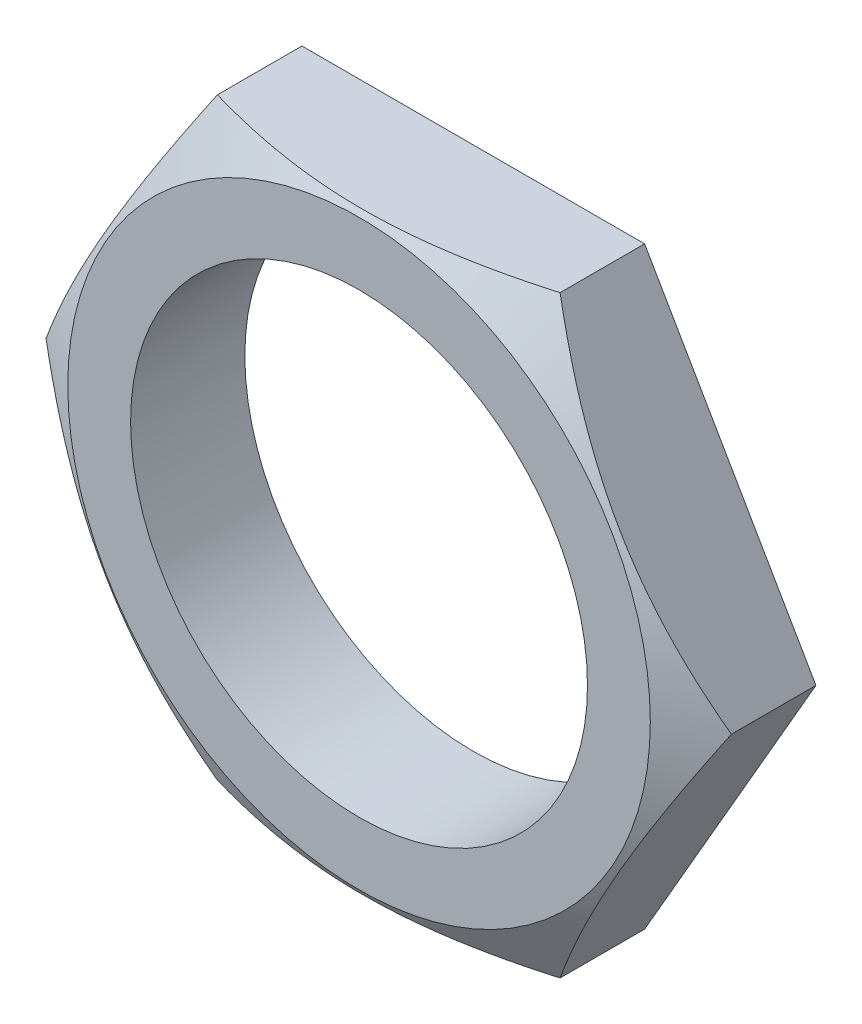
from build123d import *

# Parameters (mm, degrees)
ESQUISSE1_R                  = 6
ESQUISSE1_R_2                = 4
BASE_EXTRUSION_DEPTH         = 2
CHANFREIN1_SIZE              = 0.519615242
CHANFREIN1_SIZE2             = 0.9
ENL_V_MAT_EXTRU_1_DEPTH      = 9.717797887
R_P_TITION_CIRCULAIRE1_COUNT = 6


with BuildPart() as part:
    # Esquisse1 → Base-Extrusion (new body)
    with BuildSketch(Plane.XY):
        Circle(ESQUISSE1_R)
        Circle(ESQUISSE1_R_2, mode=Mode.SUBTRACT)
    extrude(amount=BASE_EXTRUSION_DEPTH)

    # Chanfrein1
    chanfrein1_edges = [part.edges().sort_by_distance(p)[0] for p in [
        (-6, 0, 2),
    ]]
    chanfrein1_side = [part.faces().sort_by_distance(p)[0] for p in [
        (-6, 0, 1),
    ]]
    chamfer(chanfrein1_edges, length=CHANFREIN1_SIZE, length2=CHANFREIN1_SIZE2, reference=chanfrein1_side[0])

    # Esquisse2 → Enl_v. mat.-Extru.1 (cut, through all)
    with BuildSketch(Plane(origin=(0, 0, 0), x_dir=(-1, 0, 0), z_dir=(0, 0, -1))):
        with BuildLine():
            Line((6, 0), (3, 5.196152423))
            ThreePointArc((3, 5.196152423), (5.196152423, 3), (6, 0))
        make_face()
    enl_v_mat_extru_1 = extrude(amount=-ENL_V_MAT_EXTRU_1_DEPTH, mode=Mode.SUBTRACT)

    # R_p_tition circulaire1: Enl_v. mat.-Extru.1 ×6 about axis
    r_p_tition_circulaire1_axis = Axis((0, 0, 0), (0, 0, 1))
    for i in range(1, R_P_TITION_CIRCULAIRE1_COUNT):
        add(enl_v_mat_extru_1.rotate(r_p_tition_circulaire1_axis, i * 360 / R_P_TITION_CIRCULAIRE1_COUNT), mode=Mode.SUBTRACT)


solid = part.part
